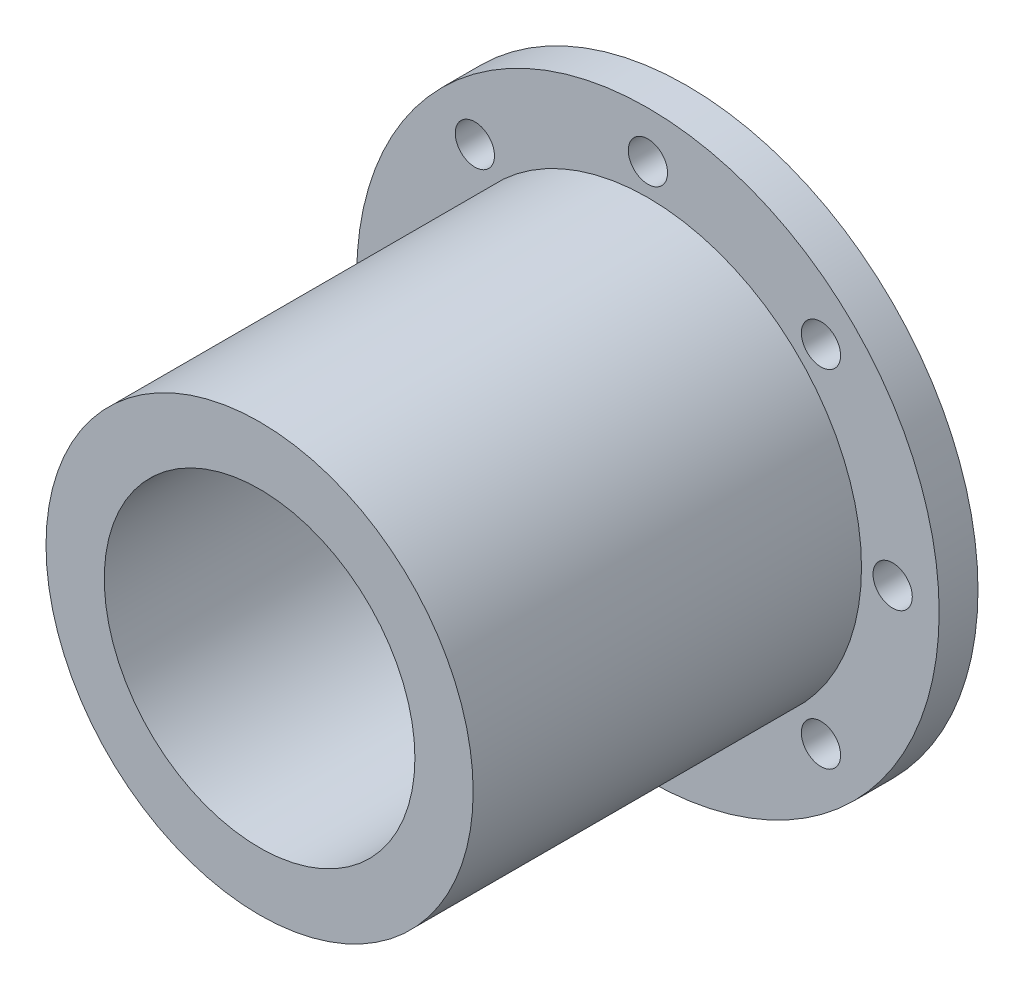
ISO-10303-21;
HEADER;
FILE_DESCRIPTION(('STEP AP214'),'2;1');
FILE_NAME('part.step','',(''),(''),'','','');
FILE_SCHEMA(('AUTOMOTIVE_DESIGN { 1 0 10303 214 1 1 1 1 }'));
ENDSEC;
DATA;
#1=APPLICATION_CONTEXT('core data for automotive mechanical design processes');
#2=APPLICATION_PROTOCOL_DEFINITION('international standard','automotive_design',2000,#1);
#3=PRODUCT_CONTEXT('',#1,'mechanical');
#4=PRODUCT('Part','Part','',(#3));
#5=PRODUCT_RELATED_PRODUCT_CATEGORY('part','',(#4));
#6=PRODUCT_DEFINITION_FORMATION('','',#4);
#7=PRODUCT_DEFINITION_CONTEXT('part definition',#1,'design');
#8=PRODUCT_DEFINITION('design','',#6,#7);
#9=PRODUCT_DEFINITION_SHAPE('','',#8);
#10=(LENGTH_UNIT() NAMED_UNIT(*) SI_UNIT(.MILLI.,.METRE.));
#11=(NAMED_UNIT(*) PLANE_ANGLE_UNIT() SI_UNIT($,.RADIAN.));
#12=(NAMED_UNIT(*) SI_UNIT($,.STERADIAN.) SOLID_ANGLE_UNIT());
#13=UNCERTAINTY_MEASURE_WITH_UNIT(LENGTH_MEASURE(1.E-05),#10,'distance_accuracy_value','');
#14=(GEOMETRIC_REPRESENTATION_CONTEXT(3) GLOBAL_UNCERTAINTY_ASSIGNED_CONTEXT((#13)) GLOBAL_UNIT_ASSIGNED_CONTEXT((#10,
#11,#12)) REPRESENTATION_CONTEXT('',''));
#15=CARTESIAN_POINT('',(0.,0.,0.));
#16=DIRECTION('',(0.,0.,1.));
#17=DIRECTION('',(1.,0.,0.));
#18=AXIS2_PLACEMENT_3D('',#15,#16,#17);
#19=CARTESIAN_POINT('',(0.,0.,-10.));
#20=DIRECTION('',(0.,0.,1.));
#21=DIRECTION('',(1.,0.,0.));
#22=AXIS2_PLACEMENT_3D('',#19,#20,#21);
#23=CYLINDRICAL_SURFACE('',#22,75.);
#24=CARTESIAN_POINT('',(0.,0.,-10.));
#25=DIRECTION('',(0.,0.,1.));
#26=DIRECTION('',(1.,0.,0.));
#27=AXIS2_PLACEMENT_3D('',#24,#25,#26);
#28=CIRCLE('',#27,75.);
#29=CARTESIAN_POINT('',(75.,0.,-10.));
#30=VERTEX_POINT('',#29);
#31=EDGE_CURVE('E11',#30,#30,#28,.T.);
#32=ORIENTED_EDGE('',*,*,#31,.T.);
#33=EDGE_LOOP('',(#32));
#34=FACE_BOUND('',#33,.T.);
#35=CARTESIAN_POINT('',(0.,0.,0.));
#36=DIRECTION('',(0.,0.,1.));
#37=DIRECTION('',(1.,0.,0.));
#38=AXIS2_PLACEMENT_3D('',#35,#36,#37);
#39=CIRCLE('',#38,75.);
#40=CARTESIAN_POINT('',(75.,0.,0.));
#41=VERTEX_POINT('',#40);
#42=EDGE_CURVE('E42',#41,#41,#39,.T.);
#43=ORIENTED_EDGE('',*,*,#42,.F.);
#44=EDGE_LOOP('',(#43));
#45=FACE_BOUND('',#44,.T.);
#46=ADVANCED_FACE('F39',(#34,#45),#23,.T.);
#47=CARTESIAN_POINT('',(0.,0.,-10.));
#48=DIRECTION('',(0.,0.,1.));
#49=DIRECTION('',(1.,0.,0.));
#50=AXIS2_PLACEMENT_3D('',#47,#48,#49);
#51=PLANE('',#50);
#52=CARTESIAN_POINT('',(0.,63.0237292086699,-10.));
#53=DIRECTION('',(0.,0.,1.));
#54=DIRECTION('',(1.,0.,0.));
#55=AXIS2_PLACEMENT_3D('',#52,#53,#54);
#56=CIRCLE('',#55,5.05453467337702);
#57=CARTESIAN_POINT('',(5.05453467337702,63.0237292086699,-10.));
#58=VERTEX_POINT('',#57);
#59=EDGE_CURVE('E54',#58,#58,#56,.T.);
#60=ORIENTED_EDGE('',*,*,#59,.T.);
#61=EDGE_LOOP('',(#60));
#62=FACE_BOUND('',#61,.T.);
#63=CARTESIAN_POINT('',(44.564506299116,44.5645062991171,-10.));
#64=DIRECTION('',(0.,0.,1.));
#65=DIRECTION('',(1.,0.,0.));
#66=AXIS2_PLACEMENT_3D('',#63,#64,#65);
#67=CIRCLE('',#66,5.05453467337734);
#68=CARTESIAN_POINT('',(49.6190409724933,44.5645062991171,-10.));
#69=VERTEX_POINT('',#68);
#70=EDGE_CURVE('E96',#69,#69,#67,.T.);
#71=ORIENTED_EDGE('',*,*,#70,.T.);
#72=EDGE_LOOP('',(#71));
#73=FACE_BOUND('',#72,.T.);
#74=CARTESIAN_POINT('',(63.0237292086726,2.67914499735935E-12,-10.));
#75=DIRECTION('',(0.,0.,1.));
#76=DIRECTION('',(1.,0.,0.));
#77=AXIS2_PLACEMENT_3D('',#74,#75,#76);
#78=CIRCLE('',#77,5.05453467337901);
#79=CARTESIAN_POINT('',(68.0782638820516,2.67914499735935E-12,-10.));
#80=VERTEX_POINT('',#79);
#81=EDGE_CURVE('E90',#80,#80,#78,.T.);
#82=ORIENTED_EDGE('',*,*,#81,.T.);
#83=EDGE_LOOP('',(#82));
#84=FACE_BOUND('',#83,.T.);
#85=CARTESIAN_POINT('',(44.5645062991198,-44.5645062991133,-10.));
#86=DIRECTION('',(0.,0.,1.));
#87=DIRECTION('',(1.,0.,0.));
#88=AXIS2_PLACEMENT_3D('',#85,#86,#87);
#89=CIRCLE('',#88,5.05453467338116);
#90=CARTESIAN_POINT('',(49.6190409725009,-44.5645062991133,-10.));
#91=VERTEX_POINT('',#90);
#92=EDGE_CURVE('E84',#91,#91,#89,.T.);
#93=ORIENTED_EDGE('',*,*,#92,.T.);
#94=EDGE_LOOP('',(#93));
#95=FACE_BOUND('',#94,.T.);
#96=CARTESIAN_POINT('',(5.3582899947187E-12,-63.0237292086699,-10.));
#97=DIRECTION('',(0.,0.,1.));
#98=DIRECTION('',(1.,0.,0.));
#99=AXIS2_PLACEMENT_3D('',#96,#97,#98);
#100=CIRCLE('',#99,5.05453467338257);
#101=CARTESIAN_POINT('',(5.05453467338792,-63.0237292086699,-10.));
#102=VERTEX_POINT('',#101);
#103=EDGE_CURVE('E78',#102,#102,#100,.T.);
#104=ORIENTED_EDGE('',*,*,#103,.T.);
#105=EDGE_LOOP('',(#104));
#106=FACE_BOUND('',#105,.T.);
#107=CARTESIAN_POINT('',(-44.5645062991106,-44.5645062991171,-10.));
#108=DIRECTION('',(0.,0.,1.));
#109=DIRECTION('',(1.,0.,0.));
#110=AXIS2_PLACEMENT_3D('',#107,#108,#109);
#111=CIRCLE('',#110,5.05453467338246);
#112=CARTESIAN_POINT('',(-39.5099716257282,-44.5645062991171,-10.));
#113=VERTEX_POINT('',#112);
#114=EDGE_CURVE('E72',#113,#113,#111,.T.);
#115=ORIENTED_EDGE('',*,*,#114,.T.);
#116=EDGE_LOOP('',(#115));
#117=FACE_BOUND('',#116,.T.);
#118=CARTESIAN_POINT('',(-63.0237292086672,-2.68686317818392E-12,-10.));
#119=DIRECTION('',(0.,0.,1.));
#120=DIRECTION('',(1.,0.,0.));
#121=AXIS2_PLACEMENT_3D('',#118,#119,#120);
#122=CIRCLE('',#121,5.054534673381);
#123=CARTESIAN_POINT('',(-57.9691945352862,-2.68686317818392E-12,-10.));
#124=VERTEX_POINT('',#123);
#125=EDGE_CURVE('E66',#124,#124,#122,.T.);
#126=ORIENTED_EDGE('',*,*,#125,.T.);
#127=EDGE_LOOP('',(#126));
#128=FACE_BOUND('',#127,.T.);
#129=CARTESIAN_POINT('',(-44.5645062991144,44.5645062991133,-10.));
#130=DIRECTION('',(0.,0.,1.));
#131=DIRECTION('',(1.,0.,0.));
#132=AXIS2_PLACEMENT_3D('',#129,#130,#131);
#133=CIRCLE('',#132,5.05453467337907);
#134=CARTESIAN_POINT('',(-39.5099716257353,44.5645062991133,-10.));
#135=VERTEX_POINT('',#134);
#136=EDGE_CURVE('E60',#135,#135,#133,.T.);
#137=ORIENTED_EDGE('',*,*,#136,.T.);
#138=EDGE_LOOP('',(#137));
#139=FACE_BOUND('',#138,.T.);
#140=CARTESIAN_POINT('',(0.,0.,-10.));
#141=DIRECTION('',(0.,0.,1.));
#142=DIRECTION('',(1.,0.,0.));
#143=AXIS2_PLACEMENT_3D('',#140,#141,#142);
#144=CIRCLE('',#143,55.);
#145=CARTESIAN_POINT('',(55.,0.,-10.));
#146=VERTEX_POINT('',#145);
#147=EDGE_CURVE('E49',#146,#146,#144,.T.);
#148=ORIENTED_EDGE('',*,*,#147,.T.);
#149=EDGE_LOOP('',(#148));
#150=FACE_BOUND('',#149,.T.);
#151=ORIENTED_EDGE('',*,*,#31,.F.);
#152=EDGE_LOOP('',(#151));
#153=FACE_BOUND('',#152,.T.);
#154=ADVANCED_FACE('F105',(#62,#73,#84,#95,#106,#117,#128,#139,#150,#153),#51,.F.);
#155=CARTESIAN_POINT('',(0.,0.,0.));
#156=DIRECTION('',(0.,0.,1.));
#157=DIRECTION('',(1.,0.,0.));
#158=AXIS2_PLACEMENT_3D('',#155,#156,#157);
#159=PLANE('',#158);
#160=CARTESIAN_POINT('',(0.,63.0237292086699,0.));
#161=DIRECTION('',(0.,0.,1.));
#162=DIRECTION('',(1.,0.,0.));
#163=AXIS2_PLACEMENT_3D('',#160,#161,#162);
#164=CIRCLE('',#163,5.05453467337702);
#165=CARTESIAN_POINT('',(5.05453467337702,63.0237292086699,0.));
#166=VERTEX_POINT('',#165);
#167=EDGE_CURVE('E99',#166,#166,#164,.T.);
#168=ORIENTED_EDGE('',*,*,#167,.F.);
#169=EDGE_LOOP('',(#168));
#170=FACE_BOUND('',#169,.T.);
#171=CARTESIAN_POINT('',(44.564506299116,44.5645062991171,0.));
#172=DIRECTION('',(0.,0.,1.));
#173=DIRECTION('',(1.,0.,0.));
#174=AXIS2_PLACEMENT_3D('',#171,#172,#173);
#175=CIRCLE('',#174,5.05453467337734);
#176=CARTESIAN_POINT('',(49.6190409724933,44.5645062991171,0.));
#177=VERTEX_POINT('',#176);
#178=EDGE_CURVE('E93',#177,#177,#175,.T.);
#179=ORIENTED_EDGE('',*,*,#178,.F.);
#180=EDGE_LOOP('',(#179));
#181=FACE_BOUND('',#180,.T.);
#182=CARTESIAN_POINT('',(63.0237292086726,2.67914499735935E-12,0.));
#183=DIRECTION('',(0.,0.,1.));
#184=DIRECTION('',(1.,0.,0.));
#185=AXIS2_PLACEMENT_3D('',#182,#183,#184);
#186=CIRCLE('',#185,5.05453467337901);
#187=CARTESIAN_POINT('',(68.0782638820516,2.67914499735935E-12,0.));
#188=VERTEX_POINT('',#187);
#189=EDGE_CURVE('E87',#188,#188,#186,.T.);
#190=ORIENTED_EDGE('',*,*,#189,.F.);
#191=EDGE_LOOP('',(#190));
#192=FACE_BOUND('',#191,.T.);
#193=CARTESIAN_POINT('',(44.5645062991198,-44.5645062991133,0.));
#194=DIRECTION('',(0.,0.,1.));
#195=DIRECTION('',(1.,0.,0.));
#196=AXIS2_PLACEMENT_3D('',#193,#194,#195);
#197=CIRCLE('',#196,5.05453467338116);
#198=CARTESIAN_POINT('',(49.6190409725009,-44.5645062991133,0.));
#199=VERTEX_POINT('',#198);
#200=EDGE_CURVE('E81',#199,#199,#197,.T.);
#201=ORIENTED_EDGE('',*,*,#200,.F.);
#202=EDGE_LOOP('',(#201));
#203=FACE_BOUND('',#202,.T.);
#204=CARTESIAN_POINT('',(5.3582899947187E-12,-63.0237292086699,0.));
#205=DIRECTION('',(0.,0.,1.));
#206=DIRECTION('',(1.,0.,0.));
#207=AXIS2_PLACEMENT_3D('',#204,#205,#206);
#208=CIRCLE('',#207,5.05453467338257);
#209=CARTESIAN_POINT('',(5.05453467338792,-63.0237292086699,0.));
#210=VERTEX_POINT('',#209);
#211=EDGE_CURVE('E75',#210,#210,#208,.T.);
#212=ORIENTED_EDGE('',*,*,#211,.F.);
#213=EDGE_LOOP('',(#212));
#214=FACE_BOUND('',#213,.T.);
#215=CARTESIAN_POINT('',(-44.5645062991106,-44.5645062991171,0.));
#216=DIRECTION('',(0.,0.,1.));
#217=DIRECTION('',(1.,0.,0.));
#218=AXIS2_PLACEMENT_3D('',#215,#216,#217);
#219=CIRCLE('',#218,5.05453467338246);
#220=CARTESIAN_POINT('',(-39.5099716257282,-44.5645062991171,0.));
#221=VERTEX_POINT('',#220);
#222=EDGE_CURVE('E69',#221,#221,#219,.T.);
#223=ORIENTED_EDGE('',*,*,#222,.F.);
#224=EDGE_LOOP('',(#223));
#225=FACE_BOUND('',#224,.T.);
#226=CARTESIAN_POINT('',(-63.0237292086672,-2.68686317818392E-12,0.));
#227=DIRECTION('',(0.,0.,1.));
#228=DIRECTION('',(1.,0.,0.));
#229=AXIS2_PLACEMENT_3D('',#226,#227,#228);
#230=CIRCLE('',#229,5.054534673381);
#231=CARTESIAN_POINT('',(-57.9691945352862,-2.68686317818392E-12,0.));
#232=VERTEX_POINT('',#231);
#233=EDGE_CURVE('E63',#232,#232,#230,.T.);
#234=ORIENTED_EDGE('',*,*,#233,.F.);
#235=EDGE_LOOP('',(#234));
#236=FACE_BOUND('',#235,.T.);
#237=CARTESIAN_POINT('',(-44.5645062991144,44.5645062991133,0.));
#238=DIRECTION('',(0.,0.,1.));
#239=DIRECTION('',(1.,0.,0.));
#240=AXIS2_PLACEMENT_3D('',#237,#238,#239);
#241=CIRCLE('',#240,5.05453467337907);
#242=CARTESIAN_POINT('',(-39.5099716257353,44.5645062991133,0.));
#243=VERTEX_POINT('',#242);
#244=EDGE_CURVE('E57',#243,#243,#241,.T.);
#245=ORIENTED_EDGE('',*,*,#244,.F.);
#246=EDGE_LOOP('',(#245));
#247=FACE_BOUND('',#246,.T.);
#248=CARTESIAN_POINT('',(0.,0.,0.));
#249=DIRECTION('',(0.,0.,1.));
#250=DIRECTION('',(1.,0.,0.));
#251=AXIS2_PLACEMENT_3D('',#248,#249,#250);
#252=CIRCLE('',#251,55.);
#253=CARTESIAN_POINT('',(55.,0.,0.));
#254=VERTEX_POINT('',#253);
#255=EDGE_CURVE('E51',#254,#254,#252,.T.);
#256=ORIENTED_EDGE('',*,*,#255,.F.);
#257=EDGE_LOOP('',(#256));
#258=FACE_BOUND('',#257,.T.);
#259=ORIENTED_EDGE('',*,*,#42,.T.);
#260=EDGE_LOOP('',(#259));
#261=FACE_BOUND('',#260,.T.);
#262=ADVANCED_FACE('F115',(#170,#181,#192,#203,#214,#225,#236,#247,#258,#261),#159,.T.);
#263=CARTESIAN_POINT('',(0.,0.,-10.));
#264=DIRECTION('',(0.,0.,1.));
#265=DIRECTION('',(1.,0.,0.));
#266=AXIS2_PLACEMENT_3D('',#263,#264,#265);
#267=CYLINDRICAL_SURFACE('',#266,55.);
#268=ORIENTED_EDGE('',*,*,#147,.F.);
#269=EDGE_LOOP('',(#268));
#270=FACE_BOUND('',#269,.T.);
#271=ORIENTED_EDGE('',*,*,#255,.T.);
#272=EDGE_LOOP('',(#271));
#273=FACE_BOUND('',#272,.T.);
#274=ADVANCED_FACE('F118',(#270,#273),#267,.F.);
#275=CARTESIAN_POINT('',(-44.5645062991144,44.5645062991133,-10.));
#276=DIRECTION('',(0.,0.,1.));
#277=DIRECTION('',(1.,0.,0.));
#278=AXIS2_PLACEMENT_3D('',#275,#276,#277);
#279=CYLINDRICAL_SURFACE('',#278,5.05453467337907);
#280=ORIENTED_EDGE('',*,*,#136,.F.);
#281=EDGE_LOOP('',(#280));
#282=FACE_BOUND('',#281,.T.);
#283=ORIENTED_EDGE('',*,*,#244,.T.);
#284=EDGE_LOOP('',(#283));
#285=FACE_BOUND('',#284,.T.);
#286=ADVANCED_FACE('F147',(#282,#285),#279,.F.);
#287=CARTESIAN_POINT('',(-63.0237292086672,-2.68686317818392E-12,-10.));
#288=DIRECTION('',(0.,0.,1.));
#289=DIRECTION('',(1.,0.,0.));
#290=AXIS2_PLACEMENT_3D('',#287,#288,#289);
#291=CYLINDRICAL_SURFACE('',#290,5.054534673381);
#292=ORIENTED_EDGE('',*,*,#125,.F.);
#293=EDGE_LOOP('',(#292));
#294=FACE_BOUND('',#293,.T.);
#295=ORIENTED_EDGE('',*,*,#233,.T.);
#296=EDGE_LOOP('',(#295));
#297=FACE_BOUND('',#296,.T.);
#298=ADVANCED_FACE('F151',(#294,#297),#291,.F.);
#299=CARTESIAN_POINT('',(-44.5645062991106,-44.5645062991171,-10.));
#300=DIRECTION('',(0.,0.,1.));
#301=DIRECTION('',(1.,0.,0.));
#302=AXIS2_PLACEMENT_3D('',#299,#300,#301);
#303=CYLINDRICAL_SURFACE('',#302,5.05453467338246);
#304=ORIENTED_EDGE('',*,*,#114,.F.);
#305=EDGE_LOOP('',(#304));
#306=FACE_BOUND('',#305,.T.);
#307=ORIENTED_EDGE('',*,*,#222,.T.);
#308=EDGE_LOOP('',(#307));
#309=FACE_BOUND('',#308,.T.);
#310=ADVANCED_FACE('F155',(#306,#309),#303,.F.);
#311=CARTESIAN_POINT('',(5.3582899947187E-12,-63.0237292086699,-10.));
#312=DIRECTION('',(0.,0.,1.));
#313=DIRECTION('',(1.,0.,0.));
#314=AXIS2_PLACEMENT_3D('',#311,#312,#313);
#315=CYLINDRICAL_SURFACE('',#314,5.05453467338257);
#316=ORIENTED_EDGE('',*,*,#103,.F.);
#317=EDGE_LOOP('',(#316));
#318=FACE_BOUND('',#317,.T.);
#319=ORIENTED_EDGE('',*,*,#211,.T.);
#320=EDGE_LOOP('',(#319));
#321=FACE_BOUND('',#320,.T.);
#322=ADVANCED_FACE('F159',(#318,#321),#315,.F.);
#323=CARTESIAN_POINT('',(44.5645062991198,-44.5645062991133,-10.));
#324=DIRECTION('',(0.,0.,1.));
#325=DIRECTION('',(1.,0.,0.));
#326=AXIS2_PLACEMENT_3D('',#323,#324,#325);
#327=CYLINDRICAL_SURFACE('',#326,5.05453467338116);
#328=ORIENTED_EDGE('',*,*,#92,.F.);
#329=EDGE_LOOP('',(#328));
#330=FACE_BOUND('',#329,.T.);
#331=ORIENTED_EDGE('',*,*,#200,.T.);
#332=EDGE_LOOP('',(#331));
#333=FACE_BOUND('',#332,.T.);
#334=ADVANCED_FACE('F163',(#330,#333),#327,.F.);
#335=CARTESIAN_POINT('',(63.0237292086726,2.67914499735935E-12,-10.));
#336=DIRECTION('',(0.,0.,1.));
#337=DIRECTION('',(1.,0.,0.));
#338=AXIS2_PLACEMENT_3D('',#335,#336,#337);
#339=CYLINDRICAL_SURFACE('',#338,5.05453467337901);
#340=ORIENTED_EDGE('',*,*,#81,.F.);
#341=EDGE_LOOP('',(#340));
#342=FACE_BOUND('',#341,.T.);
#343=ORIENTED_EDGE('',*,*,#189,.T.);
#344=EDGE_LOOP('',(#343));
#345=FACE_BOUND('',#344,.T.);
#346=ADVANCED_FACE('F167',(#342,#345),#339,.F.);
#347=CARTESIAN_POINT('',(44.564506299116,44.5645062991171,-10.));
#348=DIRECTION('',(0.,0.,1.));
#349=DIRECTION('',(1.,0.,0.));
#350=AXIS2_PLACEMENT_3D('',#347,#348,#349);
#351=CYLINDRICAL_SURFACE('',#350,5.05453467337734);
#352=ORIENTED_EDGE('',*,*,#70,.F.);
#353=EDGE_LOOP('',(#352));
#354=FACE_BOUND('',#353,.T.);
#355=ORIENTED_EDGE('',*,*,#178,.T.);
#356=EDGE_LOOP('',(#355));
#357=FACE_BOUND('',#356,.T.);
#358=ADVANCED_FACE('F111',(#354,#357),#351,.F.);
#359=CARTESIAN_POINT('',(0.,63.0237292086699,-10.));
#360=DIRECTION('',(0.,0.,1.));
#361=DIRECTION('',(1.,0.,0.));
#362=AXIS2_PLACEMENT_3D('',#359,#360,#361);
#363=CYLINDRICAL_SURFACE('',#362,5.05453467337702);
#364=ORIENTED_EDGE('',*,*,#59,.F.);
#365=EDGE_LOOP('',(#364));
#366=FACE_BOUND('',#365,.T.);
#367=ORIENTED_EDGE('',*,*,#167,.T.);
#368=EDGE_LOOP('',(#367));
#369=FACE_BOUND('',#368,.T.);
#370=ADVANCED_FACE('F108',(#366,#369),#363,.F.);
#371=CLOSED_SHELL('',(#46,#154,#262,#274,#286,#298,#310,#322,#334,#346,#358,#370));
#372=MANIFOLD_SOLID_BREP('B2',#371);
#373=CARTESIAN_POINT('',(0.,0.,100.));
#374=DIRECTION('',(0.,0.,-1.));
#375=DIRECTION('',(-1.,0.,0.));
#376=AXIS2_PLACEMENT_3D('',#373,#374,#375);
#377=CYLINDRICAL_SURFACE('',#376,40.);
#378=CARTESIAN_POINT('',(0.,0.,100.));
#379=DIRECTION('',(0.,0.,1.));
#380=DIRECTION('',(1.,0.,0.));
#381=AXIS2_PLACEMENT_3D('',#378,#379,#380);
#382=CIRCLE('',#381,40.);
#383=CARTESIAN_POINT('',(40.,0.,100.));
#384=VERTEX_POINT('',#383);
#385=EDGE_CURVE('E276',#384,#384,#382,.T.);
#386=ORIENTED_EDGE('',*,*,#385,.T.);
#387=EDGE_LOOP('',(#386));
#388=FACE_BOUND('',#387,.T.);
#389=CARTESIAN_POINT('',(0.,0.,0.));
#390=DIRECTION('',(0.,0.,1.));
#391=DIRECTION('',(1.,0.,0.));
#392=AXIS2_PLACEMENT_3D('',#389,#390,#391);
#393=CIRCLE('',#392,40.);
#394=CARTESIAN_POINT('',(40.,0.,0.));
#395=VERTEX_POINT('',#394);
#396=EDGE_CURVE('E282',#395,#395,#393,.T.);
#397=ORIENTED_EDGE('',*,*,#396,.F.);
#398=EDGE_LOOP('',(#397));
#399=FACE_BOUND('',#398,.T.);
#400=ADVANCED_FACE('F269',(#388,#399),#377,.F.);
#401=CARTESIAN_POINT('',(0.,0.,100.));
#402=DIRECTION('',(0.,0.,-1.));
#403=DIRECTION('',(-1.,0.,0.));
#404=AXIS2_PLACEMENT_3D('',#401,#402,#403);
#405=CYLINDRICAL_SURFACE('',#404,55.);
#406=CARTESIAN_POINT('',(0.,0.,100.));
#407=DIRECTION('',(0.,0.,1.));
#408=DIRECTION('',(1.,0.,0.));
#409=AXIS2_PLACEMENT_3D('',#406,#407,#408);
#410=CIRCLE('',#409,55.);
#411=CARTESIAN_POINT('',(55.,0.,100.));
#412=VERTEX_POINT('',#411);
#413=EDGE_CURVE('E38',#412,#412,#410,.T.);
#414=ORIENTED_EDGE('',*,*,#413,.F.);
#415=EDGE_LOOP('',(#414));
#416=FACE_BOUND('',#415,.T.);
#417=CARTESIAN_POINT('',(0.,0.,0.));
#418=DIRECTION('',(0.,0.,1.));
#419=DIRECTION('',(1.,0.,0.));
#420=AXIS2_PLACEMENT_3D('',#417,#418,#419);
#421=CIRCLE('',#420,55.);
#422=CARTESIAN_POINT('',(55.,0.,0.));
#423=VERTEX_POINT('',#422);
#424=EDGE_CURVE('E272',#423,#423,#421,.T.);
#425=ORIENTED_EDGE('',*,*,#424,.T.);
#426=EDGE_LOOP('',(#425));
#427=FACE_BOUND('',#426,.T.);
#428=ADVANCED_FACE('F289',(#416,#427),#405,.T.);
#429=CARTESIAN_POINT('',(0.,0.,100.));
#430=DIRECTION('',(0.,0.,1.));
#431=DIRECTION('',(1.,0.,0.));
#432=AXIS2_PLACEMENT_3D('',#429,#430,#431);
#433=PLANE('',#432);
#434=ORIENTED_EDGE('',*,*,#385,.F.);
#435=EDGE_LOOP('',(#434));
#436=FACE_BOUND('',#435,.T.);
#437=ORIENTED_EDGE('',*,*,#413,.T.);
#438=EDGE_LOOP('',(#437));
#439=FACE_BOUND('',#438,.T.);
#440=ADVANCED_FACE('F293',(#436,#439),#433,.T.);
#441=CARTESIAN_POINT('',(0.,0.,0.));
#442=DIRECTION('',(0.,0.,1.));
#443=DIRECTION('',(1.,0.,0.));
#444=AXIS2_PLACEMENT_3D('',#441,#442,#443);
#445=PLANE('',#444);
#446=ORIENTED_EDGE('',*,*,#396,.T.);
#447=EDGE_LOOP('',(#446));
#448=FACE_BOUND('',#447,.T.);
#449=ORIENTED_EDGE('',*,*,#424,.F.);
#450=EDGE_LOOP('',(#449));
#451=FACE_BOUND('',#450,.T.);
#452=ADVANCED_FACE('F291',(#448,#451),#445,.F.);
#453=CLOSED_SHELL('',(#400,#428,#440,#452));
#454=MANIFOLD_SOLID_BREP('B6',#453);
#455=ADVANCED_BREP_SHAPE_REPRESENTATION('',(#18,#372,#454),#14);
#456=SHAPE_DEFINITION_REPRESENTATION(#9,#455);
ENDSEC;
END-ISO-10303-21;
